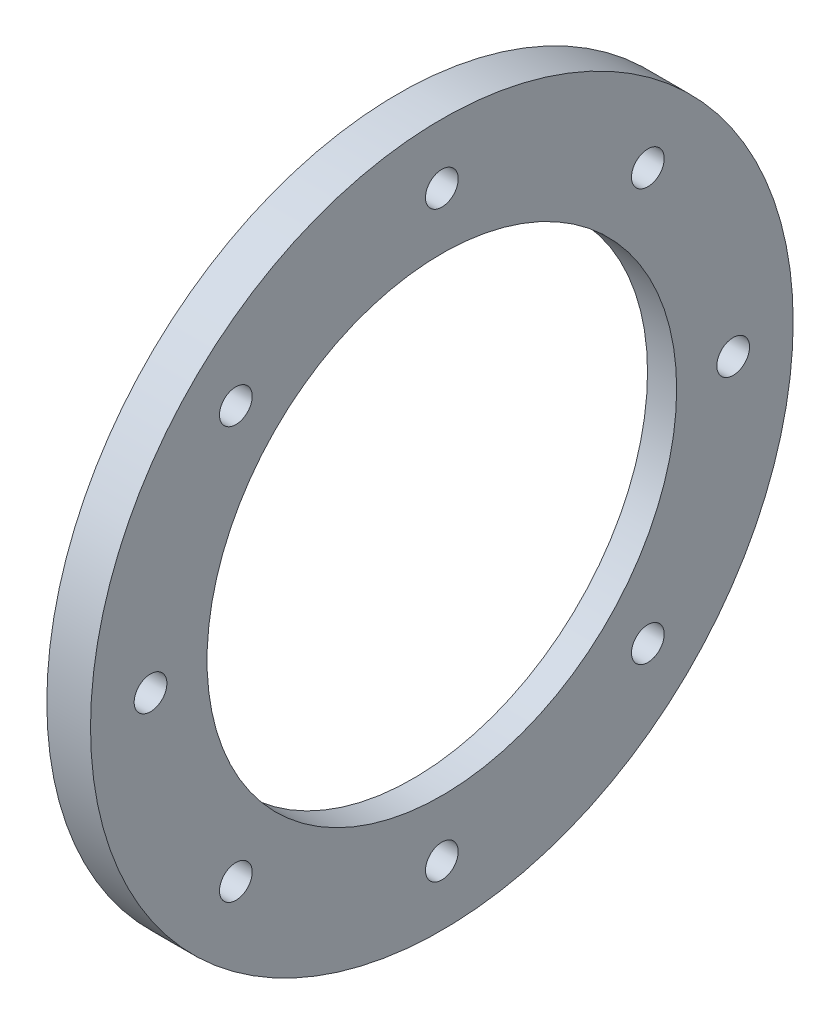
from build123d import *

# Parameters (mm, degrees)
K_0_281_DIAMETER_HOLE2_D = 7.1374


with BuildPart() as part:
    # Sketch1 → Revolve1 (revolve)
    with BuildSketch(Plane.XY, mode=Mode.PRIVATE) as revolve1_sk:
        Polygon((-212.725, 76.581), (-222.25, 76.581), (-222.25, 59.904240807), (-219.075, 51.181), (-212.725, 51.181), (-212.725, 54.356), align=None)
    revolve(revolve1_sk.sketch.rotate(Axis((0, 0, 0), (-1, 0, 0)), 90), axis=Axis((0, 0, 0), (-1, 0, 0)))

    # K _0.281_ Diameter Hole2 (through all)
    with Locations(Plane.ZY.offset(222.25)):
        with Locations((0, 63.5), (44.901280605, 44.901280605), (63.5, 0), (44.901280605, -44.901280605), (0, -63.5), (-44.901280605, -44.901280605), (-63.5, 0), (-44.901280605, 44.901280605)):
            Hole(K_0_281_DIAMETER_HOLE2_D / 2)


solid = part.part
